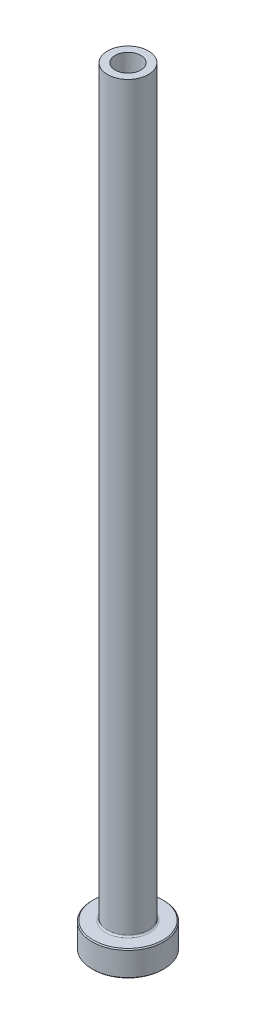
from build123d import *

# Parameters (mm, degrees)
FILLET1_R     = 0.3
CHAMFER1_SIZE = 0.2
CHAMFER3_SIZE = 0.5


with BuildPart() as part:
    # Sketch1 → Revolve1 (revolve)
    with BuildSketch(Plane.XY, mode=Mode.PRIVATE) as revolve1_sk:
        Polygon((-2.5, 150), (-4, 150), (-4, 5), (-7, 5), (-7, 0), (-2.75, 0), (-2.75, 93), (-2.5, 105), align=None)
    revolve(revolve1_sk.sketch.rotate(Axis((0, 92.187680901, 0), (0, -1, 0)), 270), axis=Axis((0, 92.187680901, 0), (0, -1, 0)))

    # Fillet1
    fillet1_edges = [part.edges().sort_by_distance(p)[0] for p in [
        (0, 5, -4),
    ]]
    fillet(fillet1_edges, radius=FILLET1_R)

    # Chamfer1
    chamfer1_edges = [part.edges().sort_by_distance(p)[0] for p in [
        (0, 0, -7),
        (0, 5, -7),
    ]]
    chamfer(chamfer1_edges, length=CHAMFER1_SIZE)

    # Chamfer3
    chamfer3_edges = [part.edges().sort_by_distance(p)[0] for p in [
        (0, 0, -2.75),
    ]]
    chamfer(chamfer3_edges, length=CHAMFER3_SIZE)


solid = part.part
